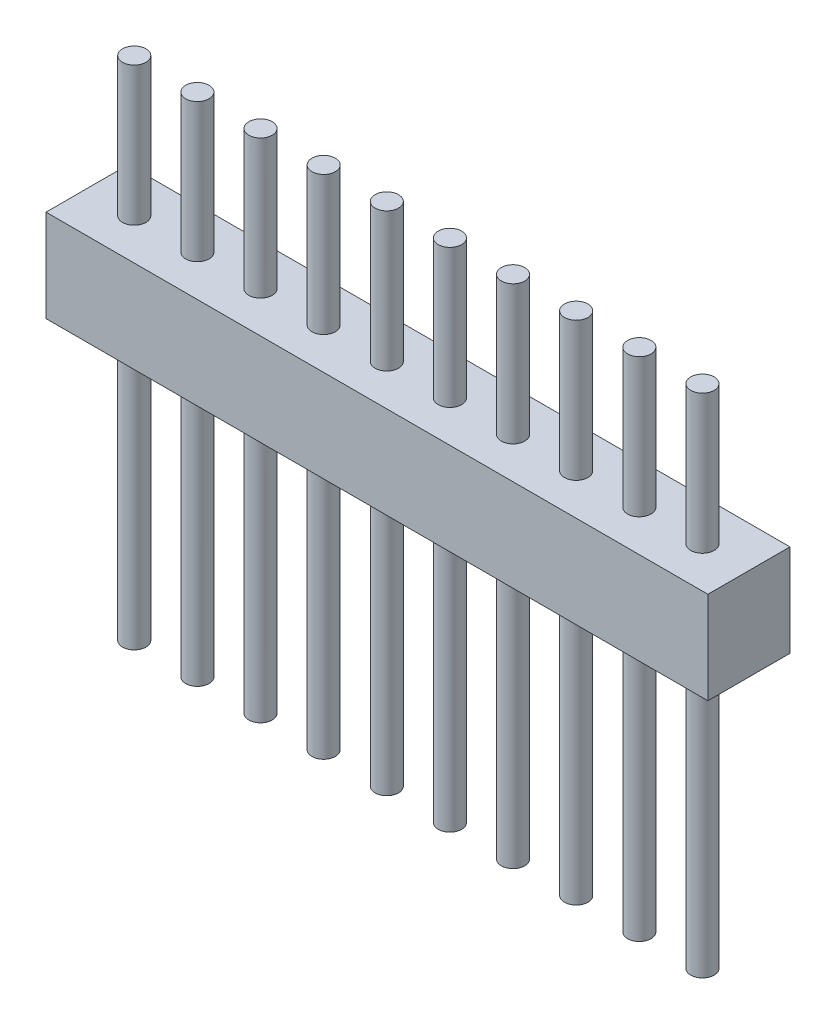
from build123d import *

# Parameters (mm, degrees)
SKETCH1_W                = 18.66
SKETCH1_H                = 2.314
BOSS_EXTRUDE1_DEPTH      = 2.6
BOSS_EXTRUDE2_DEPTH      = 3.91
BOSS_EXTRUDE2_DEPTH_BACK = 10.37
SKETCH2_R                = 0.33


with BuildPart() as part:
    # Sketch1 → Boss-Extrude1 (new body)
    with BuildSketch(Plane(origin=(0, 0, 0), x_dir=(1, 0, 0), z_dir=(0, 1, 0))):
        with Locations((9.33, 1.157)):
            Rectangle(SKETCH1_W, SKETCH1_H)
    extrude(amount=BOSS_EXTRUDE1_DEPTH)

    # Sketch2 → Boss-Extrude2 (add, two sides: drawn at the far end of the back side and taken through both)
    with BuildSketch(Plane(origin=(0, 2.6, 0), x_dir=(1, 0, 0), z_dir=(0, 1, 0)).offset(-BOSS_EXTRUDE2_DEPTH_BACK)):
        with Locations(Location((1.33, 1.157, 0), (0, 0, 270))):
            Circle(SKETCH2_R)
        with Locations(Location((3.11, 1.157, 0), (0, 0, 270))):
            Circle(SKETCH2_R)
        with Locations(Location((4.89, 1.157, 0), (0, 0, 270))):
            Circle(SKETCH2_R)
        with Locations(Location((6.67, 1.157, 0), (0, 0, 270))):
            Circle(SKETCH2_R)
        with Locations(Location((8.45, 1.157, 0), (0, 0, 270))):
            Circle(SKETCH2_R)
        with Locations(Location((10.23, 1.157, 0), (0, 0, 270))):
            Circle(SKETCH2_R)
        with Locations(Location((12.01, 1.157, 0), (0, 0, 270))):
            Circle(SKETCH2_R)
        with Locations(Location((13.79, 1.157, 0), (0, 0, 270))):
            Circle(SKETCH2_R)
        with Locations(Location((15.57, 1.157, 0), (0, 0, 270))):
            Circle(SKETCH2_R)
        with Locations(Location((17.35, 1.157, 0), (0, 0, 270))):
            Circle(SKETCH2_R)
    extrude(amount=BOSS_EXTRUDE2_DEPTH + BOSS_EXTRUDE2_DEPTH_BACK)


solid = part.part
